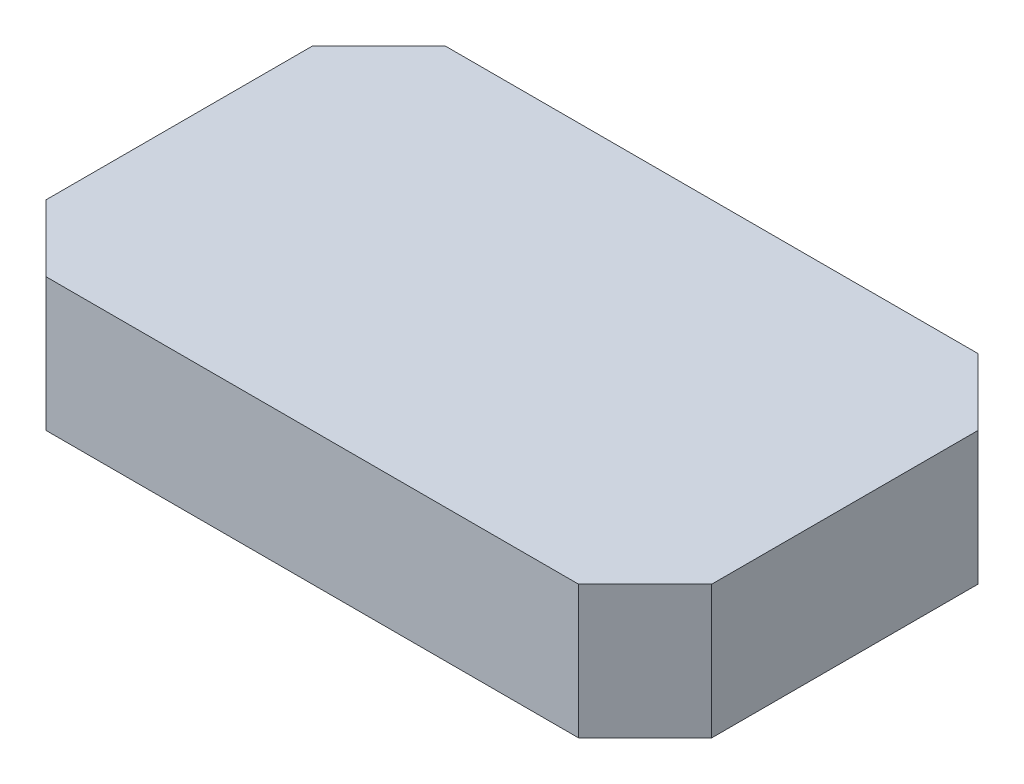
ISO-10303-21;
HEADER;
FILE_DESCRIPTION(('STEP AP214'),'2;1');
FILE_NAME('part.step','',(''),(''),'','','');
FILE_SCHEMA(('AUTOMOTIVE_DESIGN { 1 0 10303 214 1 1 1 1 }'));
ENDSEC;
DATA;
#1=APPLICATION_CONTEXT('core data for automotive mechanical design processes');
#2=APPLICATION_PROTOCOL_DEFINITION('international standard','automotive_design',2000,#1);
#3=PRODUCT_CONTEXT('',#1,'mechanical');
#4=PRODUCT('Part','Part','',(#3));
#5=PRODUCT_RELATED_PRODUCT_CATEGORY('part','',(#4));
#6=PRODUCT_DEFINITION_FORMATION('','',#4);
#7=PRODUCT_DEFINITION_CONTEXT('part definition',#1,'design');
#8=PRODUCT_DEFINITION('design','',#6,#7);
#9=PRODUCT_DEFINITION_SHAPE('','',#8);
#10=(LENGTH_UNIT() NAMED_UNIT(*) SI_UNIT(.MILLI.,.METRE.));
#11=(NAMED_UNIT(*) PLANE_ANGLE_UNIT() SI_UNIT($,.RADIAN.));
#12=(NAMED_UNIT(*) SI_UNIT($,.STERADIAN.) SOLID_ANGLE_UNIT());
#13=UNCERTAINTY_MEASURE_WITH_UNIT(LENGTH_MEASURE(1.E-05),#10,'distance_accuracy_value','');
#14=(GEOMETRIC_REPRESENTATION_CONTEXT(3) GLOBAL_UNCERTAINTY_ASSIGNED_CONTEXT((#13)) GLOBAL_UNIT_ASSIGNED_CONTEXT((#10,
#11,#12)) REPRESENTATION_CONTEXT('',''));
#15=CARTESIAN_POINT('',(0.,0.,0.));
#16=DIRECTION('',(0.,0.,1.));
#17=DIRECTION('',(1.,0.,0.));
#18=AXIS2_PLACEMENT_3D('',#15,#16,#17);
#19=CARTESIAN_POINT('',(25.,10.,15.));
#20=DIRECTION('',(-1.,0.,0.));
#21=DIRECTION('',(0.,0.,1.));
#22=AXIS2_PLACEMENT_3D('',#19,#20,#21);
#23=PLANE('',#22);
#24=DIRECTION('',(0.,0.,-1.));
#25=VECTOR('',#24,1.);
#26=CARTESIAN_POINT('',(25.,10.,15.));
#27=LINE('',#26,#25);
#28=CARTESIAN_POINT('',(25.,10.,10.));
#29=VERTEX_POINT('',#28);
#30=CARTESIAN_POINT('',(25.,10.,-9.99999999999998));
#31=VERTEX_POINT('',#30);
#32=EDGE_CURVE('E118',#29,#31,#27,.T.);
#33=ORIENTED_EDGE('',*,*,#32,.F.);
#34=DIRECTION('',(0.,-1.,0.));
#35=VECTOR('',#34,1.);
#36=CARTESIAN_POINT('',(25.,10.,10.));
#37=LINE('',#36,#35);
#38=CARTESIAN_POINT('',(25.,0.,10.));
#39=VERTEX_POINT('',#38);
#40=EDGE_CURVE('E103',#29,#39,#37,.T.);
#41=ORIENTED_EDGE('',*,*,#40,.T.);
#42=DIRECTION('',(0.,0.,-1.));
#43=VECTOR('',#42,1.);
#44=CARTESIAN_POINT('',(25.,0.,15.));
#45=LINE('',#44,#43);
#46=CARTESIAN_POINT('',(25.,0.,-9.99999999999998));
#47=VERTEX_POINT('',#46);
#48=EDGE_CURVE('E115',#39,#47,#45,.T.);
#49=ORIENTED_EDGE('',*,*,#48,.T.);
#50=DIRECTION('',(0.,1.,0.));
#51=VECTOR('',#50,1.);
#52=CARTESIAN_POINT('',(25.,10.,-9.99999999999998));
#53=LINE('',#52,#51);
#54=EDGE_CURVE('E120',#47,#31,#53,.T.);
#55=ORIENTED_EDGE('',*,*,#54,.T.);
#56=EDGE_LOOP('',(#33,#41,#49,#55));
#57=FACE_BOUND('',#56,.T.);
#58=ADVANCED_FACE('F33',(#57),#23,.F.);
#59=CARTESIAN_POINT('',(-25.,10.,-15.));
#60=DIRECTION('',(0.,0.,1.));
#61=DIRECTION('',(1.,0.,0.));
#62=AXIS2_PLACEMENT_3D('',#59,#60,#61);
#63=PLANE('',#62);
#64=DIRECTION('',(-1.,0.,0.));
#65=VECTOR('',#64,1.);
#66=CARTESIAN_POINT('',(-25.,10.,-15.));
#67=LINE('',#66,#65);
#68=CARTESIAN_POINT('',(20.,10.,-15.));
#69=VERTEX_POINT('',#68);
#70=CARTESIAN_POINT('',(-20.,10.,-15.));
#71=VERTEX_POINT('',#70);
#72=EDGE_CURVE('E160',#69,#71,#67,.T.);
#73=ORIENTED_EDGE('',*,*,#72,.F.);
#74=DIRECTION('',(0.,-1.,0.));
#75=VECTOR('',#74,1.);
#76=CARTESIAN_POINT('',(20.,10.,-15.));
#77=LINE('',#76,#75);
#78=CARTESIAN_POINT('',(20.,0.,-15.));
#79=VERTEX_POINT('',#78);
#80=EDGE_CURVE('E153',#69,#79,#77,.T.);
#81=ORIENTED_EDGE('',*,*,#80,.T.);
#82=DIRECTION('',(-1.,0.,0.));
#83=VECTOR('',#82,1.);
#84=CARTESIAN_POINT('',(-25.,0.,-15.));
#85=LINE('',#84,#83);
#86=CARTESIAN_POINT('',(-20.,0.,-15.));
#87=VERTEX_POINT('',#86);
#88=EDGE_CURVE('E124',#79,#87,#85,.T.);
#89=ORIENTED_EDGE('',*,*,#88,.T.);
#90=DIRECTION('',(0.,1.,0.));
#91=VECTOR('',#90,1.);
#92=CARTESIAN_POINT('',(-20.,10.,-15.));
#93=LINE('',#92,#91);
#94=EDGE_CURVE('E151',#87,#71,#93,.T.);
#95=ORIENTED_EDGE('',*,*,#94,.T.);
#96=EDGE_LOOP('',(#73,#81,#89,#95));
#97=FACE_BOUND('',#96,.T.);
#98=ADVANCED_FACE('F158',(#97),#63,.F.);
#99=CARTESIAN_POINT('',(-25.,10.,15.));
#100=DIRECTION('',(1.,0.,0.));
#101=DIRECTION('',(0.,0.,-1.));
#102=AXIS2_PLACEMENT_3D('',#99,#100,#101);
#103=PLANE('',#102);
#104=DIRECTION('',(0.,0.,1.));
#105=VECTOR('',#104,1.);
#106=CARTESIAN_POINT('',(-25.,10.,15.));
#107=LINE('',#106,#105);
#108=CARTESIAN_POINT('',(-25.,10.,-9.99999999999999));
#109=VERTEX_POINT('',#108);
#110=CARTESIAN_POINT('',(-25.,10.,9.99999999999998));
#111=VERTEX_POINT('',#110);
#112=EDGE_CURVE('E168',#109,#111,#107,.T.);
#113=ORIENTED_EDGE('',*,*,#112,.F.);
#114=DIRECTION('',(0.,-1.,0.));
#115=VECTOR('',#114,1.);
#116=CARTESIAN_POINT('',(-25.,10.,-9.99999999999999));
#117=LINE('',#116,#115);
#118=CARTESIAN_POINT('',(-25.,0.,-9.99999999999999));
#119=VERTEX_POINT('',#118);
#120=EDGE_CURVE('E11',#109,#119,#117,.T.);
#121=ORIENTED_EDGE('',*,*,#120,.T.);
#122=DIRECTION('',(0.,0.,1.));
#123=VECTOR('',#122,1.);
#124=CARTESIAN_POINT('',(-25.,0.,15.));
#125=LINE('',#124,#123);
#126=CARTESIAN_POINT('',(-25.,0.,9.99999999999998));
#127=VERTEX_POINT('',#126);
#128=EDGE_CURVE('E127',#119,#127,#125,.T.);
#129=ORIENTED_EDGE('',*,*,#128,.T.);
#130=DIRECTION('',(0.,1.,0.));
#131=VECTOR('',#130,1.);
#132=CARTESIAN_POINT('',(-25.,10.,9.99999999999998));
#133=LINE('',#132,#131);
#134=EDGE_CURVE('E41',#127,#111,#133,.T.);
#135=ORIENTED_EDGE('',*,*,#134,.T.);
#136=EDGE_LOOP('',(#113,#121,#129,#135));
#137=FACE_BOUND('',#136,.T.);
#138=ADVANCED_FACE('F167',(#137),#103,.F.);
#139=CARTESIAN_POINT('',(-25.,10.,15.));
#140=DIRECTION('',(0.,0.,-1.));
#141=DIRECTION('',(-1.,0.,0.));
#142=AXIS2_PLACEMENT_3D('',#139,#140,#141);
#143=PLANE('',#142);
#144=DIRECTION('',(1.,0.,0.));
#145=VECTOR('',#144,1.);
#146=CARTESIAN_POINT('',(-25.,0.,15.));
#147=LINE('',#146,#145);
#148=CARTESIAN_POINT('',(-20.,0.,15.));
#149=VERTEX_POINT('',#148);
#150=CARTESIAN_POINT('',(20.,0.,15.));
#151=VERTEX_POINT('',#150);
#152=EDGE_CURVE('E134',#149,#151,#147,.T.);
#153=ORIENTED_EDGE('',*,*,#152,.T.);
#154=DIRECTION('',(0.,1.,0.));
#155=VECTOR('',#154,1.);
#156=CARTESIAN_POINT('',(20.,10.,15.));
#157=LINE('',#156,#155);
#158=CARTESIAN_POINT('',(20.,10.,15.));
#159=VERTEX_POINT('',#158);
#160=EDGE_CURVE('E104',#151,#159,#157,.T.);
#161=ORIENTED_EDGE('',*,*,#160,.T.);
#162=DIRECTION('',(1.,0.,0.));
#163=VECTOR('',#162,1.);
#164=CARTESIAN_POINT('',(-25.,10.,15.));
#165=LINE('',#164,#163);
#166=CARTESIAN_POINT('',(-20.,10.,15.));
#167=VERTEX_POINT('',#166);
#168=EDGE_CURVE('E130',#167,#159,#165,.T.);
#169=ORIENTED_EDGE('',*,*,#168,.F.);
#170=DIRECTION('',(0.,-1.,0.));
#171=VECTOR('',#170,1.);
#172=CARTESIAN_POINT('',(-20.,10.,15.));
#173=LINE('',#172,#171);
#174=EDGE_CURVE('E109',#167,#149,#173,.T.);
#175=ORIENTED_EDGE('',*,*,#174,.T.);
#176=EDGE_LOOP('',(#153,#161,#169,#175));
#177=FACE_BOUND('',#176,.T.);
#178=ADVANCED_FACE('F191',(#177),#143,.F.);
#179=CARTESIAN_POINT('',(0.,10.,0.));
#180=DIRECTION('',(0.,-1.,0.));
#181=DIRECTION('',(0.,0.,-1.));
#182=AXIS2_PLACEMENT_3D('',#179,#180,#181);
#183=PLANE('',#182);
#184=ORIENTED_EDGE('',*,*,#168,.T.);
#185=DIRECTION('',(-0.707106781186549,0.,0.707106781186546));
#186=VECTOR('',#185,1.);
#187=CARTESIAN_POINT('',(25.,10.,10.));
#188=LINE('',#187,#186);
#189=EDGE_CURVE('E149',#159,#29,#188,.F.);
#190=ORIENTED_EDGE('',*,*,#189,.T.);
#191=ORIENTED_EDGE('',*,*,#32,.T.);
#192=DIRECTION('',(0.707106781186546,0.,0.707106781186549));
#193=VECTOR('',#192,1.);
#194=CARTESIAN_POINT('',(20.,10.,-15.));
#195=LINE('',#194,#193);
#196=EDGE_CURVE('E147',#31,#69,#195,.F.);
#197=ORIENTED_EDGE('',*,*,#196,.T.);
#198=ORIENTED_EDGE('',*,*,#72,.T.);
#199=DIRECTION('',(0.707106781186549,0.,-0.707106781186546));
#200=VECTOR('',#199,1.);
#201=CARTESIAN_POINT('',(-25.,10.,-9.99999999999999));
#202=LINE('',#201,#200);
#203=EDGE_CURVE('E54',#71,#109,#202,.F.);
#204=ORIENTED_EDGE('',*,*,#203,.T.);
#205=ORIENTED_EDGE('',*,*,#112,.T.);
#206=DIRECTION('',(-0.707106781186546,0.,-0.707106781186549));
#207=VECTOR('',#206,1.);
#208=CARTESIAN_POINT('',(-20.,10.,15.));
#209=LINE('',#208,#207);
#210=EDGE_CURVE('E144',#111,#167,#209,.F.);
#211=ORIENTED_EDGE('',*,*,#210,.T.);
#212=EDGE_LOOP('',(#184,#190,#191,#197,#198,#204,#205,#211));
#213=FACE_BOUND('',#212,.T.);
#214=ADVANCED_FACE('F173',(#213),#183,.F.);
#215=CARTESIAN_POINT('',(0.,0.,0.));
#216=DIRECTION('',(0.,-1.,0.));
#217=DIRECTION('',(0.,0.,-1.));
#218=AXIS2_PLACEMENT_3D('',#215,#216,#217);
#219=PLANE('',#218);
#220=ORIENTED_EDGE('',*,*,#48,.F.);
#221=DIRECTION('',(0.707106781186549,0.,-0.707106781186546));
#222=VECTOR('',#221,1.);
#223=CARTESIAN_POINT('',(17.4999999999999,0.,17.5));
#224=LINE('',#223,#222);
#225=EDGE_CURVE('E99',#39,#151,#224,.F.);
#226=ORIENTED_EDGE('',*,*,#225,.T.);
#227=ORIENTED_EDGE('',*,*,#152,.F.);
#228=DIRECTION('',(0.707106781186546,0.,0.707106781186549));
#229=VECTOR('',#228,1.);
#230=CARTESIAN_POINT('',(-17.5,0.,17.5));
#231=LINE('',#230,#229);
#232=EDGE_CURVE('E119',#149,#127,#231,.F.);
#233=ORIENTED_EDGE('',*,*,#232,.T.);
#234=ORIENTED_EDGE('',*,*,#128,.F.);
#235=DIRECTION('',(-0.707106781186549,0.,0.707106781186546));
#236=VECTOR('',#235,1.);
#237=CARTESIAN_POINT('',(-17.4999999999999,0.,-17.5));
#238=LINE('',#237,#236);
#239=EDGE_CURVE('E138',#119,#87,#238,.F.);
#240=ORIENTED_EDGE('',*,*,#239,.T.);
#241=ORIENTED_EDGE('',*,*,#88,.F.);
#242=DIRECTION('',(-0.707106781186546,0.,-0.707106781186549));
#243=VECTOR('',#242,1.);
#244=CARTESIAN_POINT('',(17.5,0.,-17.5));
#245=LINE('',#244,#243);
#246=EDGE_CURVE('E110',#79,#47,#245,.F.);
#247=ORIENTED_EDGE('',*,*,#246,.T.);
#248=EDGE_LOOP('',(#220,#226,#227,#233,#234,#240,#241,#247));
#249=FACE_BOUND('',#248,.T.);
#250=ADVANCED_FACE('F122',(#249),#219,.T.);
#251=CARTESIAN_POINT('',(25.,10.,10.));
#252=DIRECTION('',(-0.707106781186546,0.,-0.707106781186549));
#253=DIRECTION('',(0.,-1.,0.));
#254=AXIS2_PLACEMENT_3D('',#251,#252,#253);
#255=PLANE('',#254);
#256=ORIENTED_EDGE('',*,*,#189,.F.);
#257=ORIENTED_EDGE('',*,*,#160,.F.);
#258=ORIENTED_EDGE('',*,*,#225,.F.);
#259=ORIENTED_EDGE('',*,*,#40,.F.);
#260=EDGE_LOOP('',(#256,#257,#258,#259));
#261=FACE_BOUND('',#260,.T.);
#262=ADVANCED_FACE('F102',(#261),#255,.F.);
#263=CARTESIAN_POINT('',(20.,10.,-15.));
#264=DIRECTION('',(-0.707106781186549,0.,0.707106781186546));
#265=DIRECTION('',(0.,-1.,0.));
#266=AXIS2_PLACEMENT_3D('',#263,#264,#265);
#267=PLANE('',#266);
#268=ORIENTED_EDGE('',*,*,#196,.F.);
#269=ORIENTED_EDGE('',*,*,#54,.F.);
#270=ORIENTED_EDGE('',*,*,#246,.F.);
#271=ORIENTED_EDGE('',*,*,#80,.F.);
#272=EDGE_LOOP('',(#268,#269,#270,#271));
#273=FACE_BOUND('',#272,.T.);
#274=ADVANCED_FACE('F174',(#273),#267,.F.);
#275=CARTESIAN_POINT('',(-25.,10.,-9.99999999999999));
#276=DIRECTION('',(0.707106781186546,0.,0.707106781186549));
#277=DIRECTION('',(0.,-1.,0.));
#278=AXIS2_PLACEMENT_3D('',#275,#276,#277);
#279=PLANE('',#278);
#280=ORIENTED_EDGE('',*,*,#203,.F.);
#281=ORIENTED_EDGE('',*,*,#94,.F.);
#282=ORIENTED_EDGE('',*,*,#239,.F.);
#283=ORIENTED_EDGE('',*,*,#120,.F.);
#284=EDGE_LOOP('',(#280,#281,#282,#283));
#285=FACE_BOUND('',#284,.T.);
#286=ADVANCED_FACE('F166',(#285),#279,.F.);
#287=CARTESIAN_POINT('',(-20.,10.,15.));
#288=DIRECTION('',(0.707106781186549,0.,-0.707106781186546));
#289=DIRECTION('',(0.,-1.,0.));
#290=AXIS2_PLACEMENT_3D('',#287,#288,#289);
#291=PLANE('',#290);
#292=ORIENTED_EDGE('',*,*,#210,.F.);
#293=ORIENTED_EDGE('',*,*,#134,.F.);
#294=ORIENTED_EDGE('',*,*,#232,.F.);
#295=ORIENTED_EDGE('',*,*,#174,.F.);
#296=EDGE_LOOP('',(#292,#293,#294,#295));
#297=FACE_BOUND('',#296,.T.);
#298=ADVANCED_FACE('F35',(#297),#291,.F.);
#299=CLOSED_SHELL('',(#58,#98,#138,#178,#214,#250,#262,#274,#286,#298));
#300=MANIFOLD_SOLID_BREP('B2',#299);
#301=ADVANCED_BREP_SHAPE_REPRESENTATION('',(#18,#300),#14);
#302=SHAPE_DEFINITION_REPRESENTATION(#9,#301);
ENDSEC;
END-ISO-10303-21;
